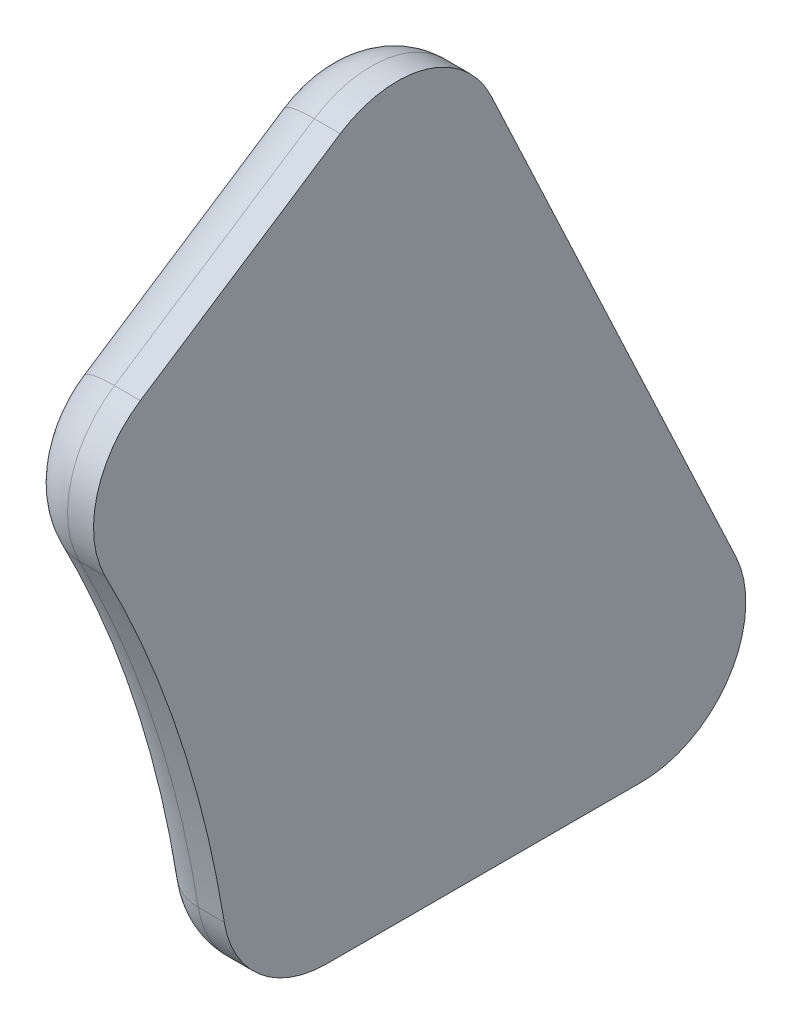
from build123d import *

# Parameters (mm, degrees)
SALIENTE_EXTRUIR1_DEPTH = 15
REDONDEO1_R             = 10


with BuildPart() as part:
    # Croquis1 → Saliente-Extruir1 (new body)
    with BuildSketch(Plane(origin=(0, 0, 0), x_dir=(0, 0, -1), z_dir=(1, 0, 0))):
        with BuildLine():
            Line((12994.164118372, 4904.59832959), (13041.39353255, 4803.986902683))
            ThreePointArc((13041.39353255, 4803.986902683), (13040.170597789, 4784.763802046), (13023.28904578, 4775.488222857))
            Line((13023.28904578, 4775.488222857), (12962.46593595, 4775.488222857))
            ThreePointArc((12962.46593595, 4775.488222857), (12949.504454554, 4780.256676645), (12942.723595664, 4792.288222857))
            ThreePointArc((12942.723595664, 4792.288222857), (12934.007452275, 4827.848719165), (12919.758920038, 4861.575553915))
            ThreePointArc((12919.758920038, 4861.575553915), (12918.152803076, 4875.852106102), (12926.532053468, 4887.522055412))
            Line((12926.532053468, 4887.522055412), (12965.08735306, 4912.821165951))
            ThreePointArc((12965.08735306, 4912.821165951), (12981.502136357, 4915.344886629), (12994.164118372, 4904.59832959))
        make_face()
    extrude(amount=SALIENTE_EXTRUIR1_DEPTH)

    # Redondeo1
    redondeo1_edges = [part.edges().sort_by_distance(p)[0] for p in [
        (0, 4900.171610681, -12945.809703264),
        (0, 4915.344886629, -12981.502136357),
        (0, 4854.292616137, -13017.778825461),
        (0, 4784.763802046, -13040.170597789),
        (0, 4775.488222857, -12992.877490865),
        (0, 4780.256676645, -12949.504454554),
        (0, 4827.848719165, -12934.007452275),
        (0, 4875.852106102, -12918.152803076),
    ]]
    fillet(redondeo1_edges, radius=REDONDEO1_R)


solid = part.part
